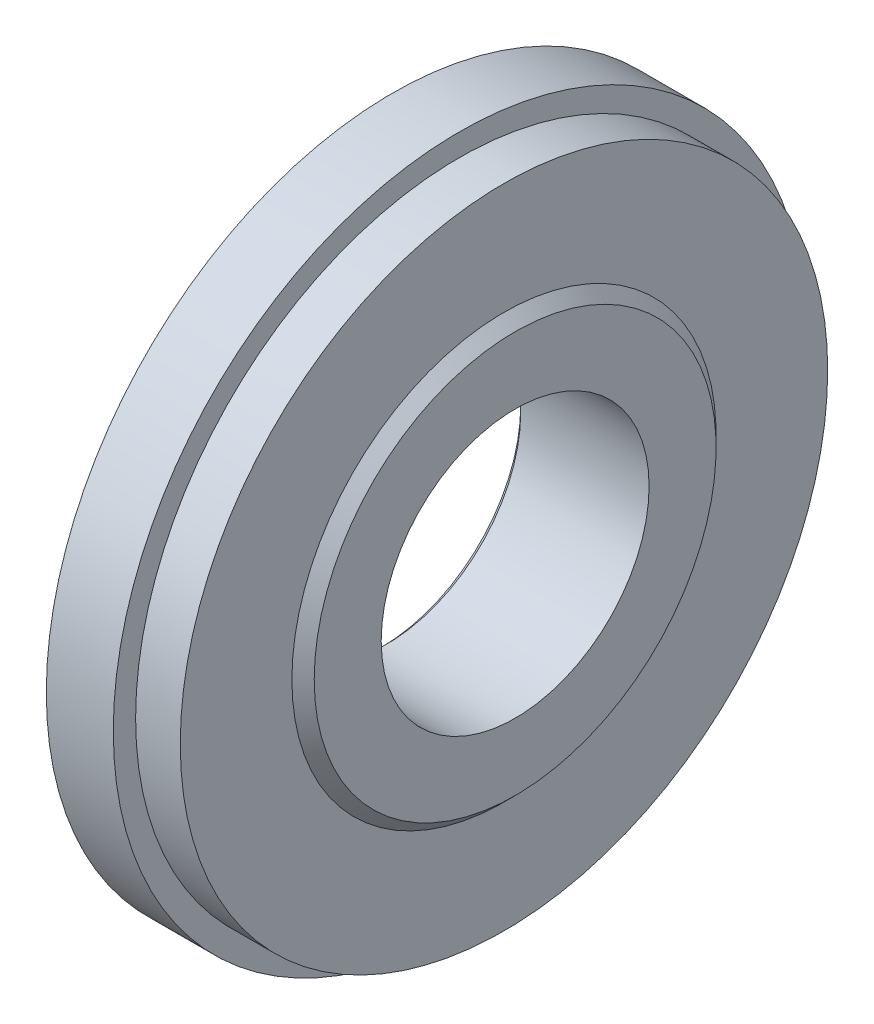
ISO-10303-21;
HEADER;
FILE_DESCRIPTION(('STEP AP214'),'2;1');
FILE_NAME('part.step','',(''),(''),'','','');
FILE_SCHEMA(('AUTOMOTIVE_DESIGN { 1 0 10303 214 1 1 1 1 }'));
ENDSEC;
DATA;
#1=APPLICATION_CONTEXT('core data for automotive mechanical design processes');
#2=APPLICATION_PROTOCOL_DEFINITION('international standard','automotive_design',2000,#1);
#3=PRODUCT_CONTEXT('',#1,'mechanical');
#4=PRODUCT('Part','Part','',(#3));
#5=PRODUCT_RELATED_PRODUCT_CATEGORY('part','',(#4));
#6=PRODUCT_DEFINITION_FORMATION('','',#4);
#7=PRODUCT_DEFINITION_CONTEXT('part definition',#1,'design');
#8=PRODUCT_DEFINITION('design','',#6,#7);
#9=PRODUCT_DEFINITION_SHAPE('','',#8);
#10=(LENGTH_UNIT() NAMED_UNIT(*) SI_UNIT(.MILLI.,.METRE.));
#11=(NAMED_UNIT(*) PLANE_ANGLE_UNIT() SI_UNIT($,.RADIAN.));
#12=(NAMED_UNIT(*) SI_UNIT($,.STERADIAN.) SOLID_ANGLE_UNIT());
#13=UNCERTAINTY_MEASURE_WITH_UNIT(LENGTH_MEASURE(1.E-05),#10,'distance_accuracy_value','');
#14=(GEOMETRIC_REPRESENTATION_CONTEXT(3) GLOBAL_UNCERTAINTY_ASSIGNED_CONTEXT((#13)) GLOBAL_UNIT_ASSIGNED_CONTEXT((#10,
#11,#12)) REPRESENTATION_CONTEXT('',''));
#15=CARTESIAN_POINT('',(0.,0.,0.));
#16=DIRECTION('',(0.,0.,1.));
#17=DIRECTION('',(1.,0.,0.));
#18=AXIS2_PLACEMENT_3D('',#15,#16,#17);
#19=CARTESIAN_POINT('',(-8.00000000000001,0.,0.));
#20=DIRECTION('',(-1.,0.,0.));
#21=DIRECTION('',(0.,0.,1.));
#22=AXIS2_PLACEMENT_3D('',#19,#20,#21);
#23=CYLINDRICAL_SURFACE('',#22,16.);
#24=CARTESIAN_POINT('',(0.500000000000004,0.,0.));
#25=DIRECTION('',(-1.,0.,0.));
#26=DIRECTION('',(0.,0.,1.));
#27=AXIS2_PLACEMENT_3D('',#24,#25,#26);
#28=CIRCLE('',#27,16.);
#29=CARTESIAN_POINT('',(0.500000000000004,0.,16.));
#30=VERTEX_POINT('',#29);
#31=EDGE_CURVE('E10',#30,#30,#28,.F.);
#32=ORIENTED_EDGE('',*,*,#31,.T.);
#33=EDGE_LOOP('',(#32));
#34=FACE_BOUND('',#33,.T.);
#35=CARTESIAN_POINT('',(5.00000000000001,0.,0.));
#36=DIRECTION('',(-1.,0.,0.));
#37=DIRECTION('',(0.,0.,1.));
#38=AXIS2_PLACEMENT_3D('',#35,#36,#37);
#39=CIRCLE('',#38,16.);
#40=CARTESIAN_POINT('',(5.00000000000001,0.,16.));
#41=VERTEX_POINT('',#40);
#42=EDGE_CURVE('E50',#41,#41,#39,.T.);
#43=ORIENTED_EDGE('',*,*,#42,.T.);
#44=EDGE_LOOP('',(#43));
#45=FACE_BOUND('',#44,.T.);
#46=ADVANCED_FACE('F31',(#34,#45),#23,.T.);
#47=CARTESIAN_POINT('',(5.00000000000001,0.,0.));
#48=DIRECTION('',(-1.,0.,0.));
#49=DIRECTION('',(0.,0.,1.));
#50=AXIS2_PLACEMENT_3D('',#47,#48,#49);
#51=TOROIDAL_SURFACE('',#50,18.,2.);
#52=ORIENTED_EDGE('',*,*,#42,.F.);
#53=EDGE_LOOP('',(#52));
#54=FACE_BOUND('',#53,.T.);
#55=CARTESIAN_POINT('',(7.00000000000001,0.,0.));
#56=DIRECTION('',(-1.,0.,0.));
#57=DIRECTION('',(0.,0.,1.));
#58=AXIS2_PLACEMENT_3D('',#55,#56,#57);
#59=CIRCLE('',#58,18.);
#60=CARTESIAN_POINT('',(7.00000000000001,0.,18.));
#61=VERTEX_POINT('',#60);
#62=EDGE_CURVE('E53',#61,#61,#59,.T.);
#63=ORIENTED_EDGE('',*,*,#62,.T.);
#64=EDGE_LOOP('',(#63));
#65=FACE_BOUND('',#64,.T.);
#66=ADVANCED_FACE('F104',(#54,#65),#51,.F.);
#67=CARTESIAN_POINT('',(7.00000000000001,18.,0.));
#68=DIRECTION('',(-1.,0.,0.));
#69=DIRECTION('',(0.,0.,1.));
#70=AXIS2_PLACEMENT_3D('',#67,#68,#69);
#71=PLANE('',#70);
#72=CARTESIAN_POINT('',(7.00000000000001,0.,0.));
#73=DIRECTION('',(-1.,0.,0.));
#74=DIRECTION('',(0.,0.,1.));
#75=AXIS2_PLACEMENT_3D('',#72,#73,#74);
#76=CIRCLE('',#75,26.);
#77=CARTESIAN_POINT('',(7.00000000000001,0.,26.));
#78=VERTEX_POINT('',#77);
#79=EDGE_CURVE('E56',#78,#78,#76,.T.);
#80=ORIENTED_EDGE('',*,*,#79,.T.);
#81=EDGE_LOOP('',(#80));
#82=FACE_BOUND('',#81,.T.);
#83=ORIENTED_EDGE('',*,*,#62,.F.);
#84=EDGE_LOOP('',(#83));
#85=FACE_BOUND('',#84,.T.);
#86=ADVANCED_FACE('F108',(#82,#85),#71,.T.);
#87=CARTESIAN_POINT('',(5.00000000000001,0.,0.));
#88=DIRECTION('',(-1.,0.,0.));
#89=DIRECTION('',(0.,0.,1.));
#90=AXIS2_PLACEMENT_3D('',#87,#88,#89);
#91=TOROIDAL_SURFACE('',#90,26.,2.);
#92=ORIENTED_EDGE('',*,*,#79,.F.);
#93=EDGE_LOOP('',(#92));
#94=FACE_BOUND('',#93,.T.);
#95=CARTESIAN_POINT('',(5.00000000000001,0.,0.));
#96=DIRECTION('',(-1.,0.,0.));
#97=DIRECTION('',(0.,0.,1.));
#98=AXIS2_PLACEMENT_3D('',#95,#96,#97);
#99=CIRCLE('',#98,28.);
#100=CARTESIAN_POINT('',(5.00000000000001,0.,28.));
#101=VERTEX_POINT('',#100);
#102=EDGE_CURVE('E59',#101,#101,#99,.T.);
#103=ORIENTED_EDGE('',*,*,#102,.T.);
#104=EDGE_LOOP('',(#103));
#105=FACE_BOUND('',#104,.T.);
#106=ADVANCED_FACE('F116',(#94,#105),#91,.F.);
#107=CARTESIAN_POINT('',(-8.00000000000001,0.,0.));
#108=DIRECTION('',(-1.,0.,0.));
#109=DIRECTION('',(0.,0.,1.));
#110=AXIS2_PLACEMENT_3D('',#107,#108,#109);
#111=CYLINDRICAL_SURFACE('',#110,28.);
#112=CARTESIAN_POINT('',(1.,0.,0.));
#113=DIRECTION('',(-1.,0.,0.));
#114=DIRECTION('',(0.,0.,1.));
#115=AXIS2_PLACEMENT_3D('',#112,#113,#114);
#116=CIRCLE('',#115,28.);
#117=CARTESIAN_POINT('',(1.,0.,28.));
#118=VERTEX_POINT('',#117);
#119=EDGE_CURVE('E62',#118,#118,#116,.T.);
#120=ORIENTED_EDGE('',*,*,#119,.T.);
#121=EDGE_LOOP('',(#120));
#122=FACE_BOUND('',#121,.T.);
#123=ORIENTED_EDGE('',*,*,#102,.F.);
#124=EDGE_LOOP('',(#123));
#125=FACE_BOUND('',#124,.T.);
#126=ADVANCED_FACE('F122',(#122,#125),#111,.F.);
#127=CARTESIAN_POINT('',(1.,28.,0.));
#128=DIRECTION('',(-1.,0.,0.));
#129=DIRECTION('',(0.,0.,1.));
#130=AXIS2_PLACEMENT_3D('',#127,#128,#129);
#131=PLANE('',#130);
#132=CARTESIAN_POINT('',(1.,0.,0.));
#133=DIRECTION('',(-1.,0.,0.));
#134=DIRECTION('',(0.,0.,1.));
#135=AXIS2_PLACEMENT_3D('',#132,#133,#134);
#136=CIRCLE('',#135,31.);
#137=CARTESIAN_POINT('',(1.,0.,31.));
#138=VERTEX_POINT('',#137);
#139=EDGE_CURVE('E65',#138,#138,#136,.T.);
#140=ORIENTED_EDGE('',*,*,#139,.T.);
#141=EDGE_LOOP('',(#140));
#142=FACE_BOUND('',#141,.T.);
#143=ORIENTED_EDGE('',*,*,#119,.F.);
#144=EDGE_LOOP('',(#143));
#145=FACE_BOUND('',#144,.T.);
#146=ADVANCED_FACE('F128',(#142,#145),#131,.T.);
#147=CARTESIAN_POINT('',(-8.00000000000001,0.,0.));
#148=DIRECTION('',(-1.,0.,0.));
#149=DIRECTION('',(0.,0.,1.));
#150=AXIS2_PLACEMENT_3D('',#147,#148,#149);
#151=CYLINDRICAL_SURFACE('',#150,31.);
#152=CARTESIAN_POINT('',(7.,0.,0.));
#153=DIRECTION('',(-1.,0.,0.));
#154=DIRECTION('',(0.,0.,1.));
#155=AXIS2_PLACEMENT_3D('',#152,#153,#154);
#156=CIRCLE('',#155,31.);
#157=CARTESIAN_POINT('',(7.,0.,31.));
#158=VERTEX_POINT('',#157);
#159=EDGE_CURVE('E68',#158,#158,#156,.T.);
#160=ORIENTED_EDGE('',*,*,#159,.T.);
#161=EDGE_LOOP('',(#160));
#162=FACE_BOUND('',#161,.T.);
#163=ORIENTED_EDGE('',*,*,#139,.F.);
#164=EDGE_LOOP('',(#163));
#165=FACE_BOUND('',#164,.T.);
#166=ADVANCED_FACE('F132',(#162,#165),#151,.T.);
#167=CARTESIAN_POINT('',(7.,31.,0.));
#168=DIRECTION('',(1.,0.,0.));
#169=DIRECTION('',(0.,0.,-1.));
#170=AXIS2_PLACEMENT_3D('',#167,#168,#169);
#171=PLANE('',#170);
#172=CARTESIAN_POINT('',(7.,0.,0.));
#173=DIRECTION('',(-1.,0.,0.));
#174=DIRECTION('',(0.,0.,1.));
#175=AXIS2_PLACEMENT_3D('',#172,#173,#174);
#176=CIRCLE('',#175,29.);
#177=CARTESIAN_POINT('',(7.,0.,29.));
#178=VERTEX_POINT('',#177);
#179=EDGE_CURVE('E71',#178,#178,#176,.T.);
#180=ORIENTED_EDGE('',*,*,#179,.T.);
#181=EDGE_LOOP('',(#180));
#182=FACE_BOUND('',#181,.T.);
#183=ORIENTED_EDGE('',*,*,#159,.F.);
#184=EDGE_LOOP('',(#183));
#185=FACE_BOUND('',#184,.T.);
#186=ADVANCED_FACE('F136',(#182,#185),#171,.T.);
#187=CARTESIAN_POINT('',(-8.00000000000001,0.,0.));
#188=DIRECTION('',(-1.,0.,0.));
#189=DIRECTION('',(0.,0.,1.));
#190=AXIS2_PLACEMENT_3D('',#187,#188,#189);
#191=CYLINDRICAL_SURFACE('',#190,29.);
#192=CARTESIAN_POINT('',(11.,0.,0.));
#193=DIRECTION('',(-1.,0.,0.));
#194=DIRECTION('',(0.,0.,1.));
#195=AXIS2_PLACEMENT_3D('',#192,#193,#194);
#196=CIRCLE('',#195,29.);
#197=CARTESIAN_POINT('',(11.,0.,29.));
#198=VERTEX_POINT('',#197);
#199=EDGE_CURVE('E74',#198,#198,#196,.T.);
#200=ORIENTED_EDGE('',*,*,#199,.T.);
#201=EDGE_LOOP('',(#200));
#202=FACE_BOUND('',#201,.T.);
#203=ORIENTED_EDGE('',*,*,#179,.F.);
#204=EDGE_LOOP('',(#203));
#205=FACE_BOUND('',#204,.T.);
#206=ADVANCED_FACE('F140',(#202,#205),#191,.T.);
#207=CARTESIAN_POINT('',(11.,29.,0.));
#208=DIRECTION('',(1.,0.,0.));
#209=DIRECTION('',(0.,0.,-1.));
#210=AXIS2_PLACEMENT_3D('',#207,#208,#209);
#211=PLANE('',#210);
#212=CARTESIAN_POINT('',(11.,0.,0.));
#213=DIRECTION('',(-1.,0.,0.));
#214=DIRECTION('',(0.,0.,1.));
#215=AXIS2_PLACEMENT_3D('',#212,#213,#214);
#216=CIRCLE('',#215,19.0000000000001);
#217=CARTESIAN_POINT('',(11.,0.,19.0000000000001));
#218=VERTEX_POINT('',#217);
#219=EDGE_CURVE('E77',#218,#218,#216,.T.);
#220=ORIENTED_EDGE('',*,*,#219,.T.);
#221=EDGE_LOOP('',(#220));
#222=FACE_BOUND('',#221,.T.);
#223=ORIENTED_EDGE('',*,*,#199,.F.);
#224=EDGE_LOOP('',(#223));
#225=FACE_BOUND('',#224,.T.);
#226=ADVANCED_FACE('F144',(#222,#225),#211,.T.);
#227=CARTESIAN_POINT('',(11.,0.,0.));
#228=DIRECTION('',(-1.,0.,0.));
#229=DIRECTION('',(0.,0.,1.));
#230=AXIS2_PLACEMENT_3D('',#227,#228,#229);
#231=CONICAL_SURFACE('',#230,19.0000000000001,0.785398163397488);
#232=CARTESIAN_POINT('',(12.,0.,0.));
#233=DIRECTION('',(-1.,0.,0.));
#234=DIRECTION('',(0.,0.,1.));
#235=AXIS2_PLACEMENT_3D('',#232,#233,#234);
#236=CIRCLE('',#235,18.0000000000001);
#237=CARTESIAN_POINT('',(12.,0.,18.0000000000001));
#238=VERTEX_POINT('',#237);
#239=EDGE_CURVE('E80',#238,#238,#236,.T.);
#240=ORIENTED_EDGE('',*,*,#239,.T.);
#241=EDGE_LOOP('',(#240));
#242=FACE_BOUND('',#241,.T.);
#243=ORIENTED_EDGE('',*,*,#219,.F.);
#244=EDGE_LOOP('',(#243));
#245=FACE_BOUND('',#244,.T.);
#246=ADVANCED_FACE('F101',(#242,#245),#231,.T.);
#247=CARTESIAN_POINT('',(12.,18.0000000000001,0.));
#248=DIRECTION('',(1.,0.,0.));
#249=DIRECTION('',(0.,0.,-1.));
#250=AXIS2_PLACEMENT_3D('',#247,#248,#249);
#251=PLANE('',#250);
#252=CARTESIAN_POINT('',(12.,0.,0.));
#253=DIRECTION('',(-1.,0.,0.));
#254=DIRECTION('',(0.,0.,1.));
#255=AXIS2_PLACEMENT_3D('',#252,#253,#254);
#256=CIRCLE('',#255,12.);
#257=CARTESIAN_POINT('',(12.,0.,12.));
#258=VERTEX_POINT('',#257);
#259=EDGE_CURVE('E83',#258,#258,#256,.T.);
#260=ORIENTED_EDGE('',*,*,#259,.T.);
#261=EDGE_LOOP('',(#260));
#262=FACE_BOUND('',#261,.T.);
#263=ORIENTED_EDGE('',*,*,#239,.F.);
#264=EDGE_LOOP('',(#263));
#265=FACE_BOUND('',#264,.T.);
#266=ADVANCED_FACE('F87',(#262,#265),#251,.T.);
#267=CARTESIAN_POINT('',(-8.00000000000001,0.,0.));
#268=DIRECTION('',(-1.,0.,0.));
#269=DIRECTION('',(0.,0.,1.));
#270=AXIS2_PLACEMENT_3D('',#267,#268,#269);
#271=CYLINDRICAL_SURFACE('',#270,12.);
#272=CARTESIAN_POINT('',(0.500000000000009,0.,0.));
#273=DIRECTION('',(-1.,0.,0.));
#274=DIRECTION('',(0.,0.,1.));
#275=AXIS2_PLACEMENT_3D('',#272,#273,#274);
#276=CIRCLE('',#275,12.);
#277=CARTESIAN_POINT('',(0.500000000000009,0.,12.));
#278=VERTEX_POINT('',#277);
#279=EDGE_CURVE('E45',#278,#278,#276,.T.);
#280=ORIENTED_EDGE('',*,*,#279,.T.);
#281=EDGE_LOOP('',(#280));
#282=FACE_BOUND('',#281,.T.);
#283=ORIENTED_EDGE('',*,*,#259,.F.);
#284=EDGE_LOOP('',(#283));
#285=FACE_BOUND('',#284,.T.);
#286=ADVANCED_FACE('F90',(#282,#285),#271,.F.);
#287=CARTESIAN_POINT('',(0.,12.,0.));
#288=DIRECTION('',(-1.,0.,0.));
#289=DIRECTION('',(0.,0.,1.));
#290=AXIS2_PLACEMENT_3D('',#287,#288,#289);
#291=PLANE('',#290);
#292=CARTESIAN_POINT('',(0.,0.,0.));
#293=DIRECTION('',(-1.,0.,0.));
#294=DIRECTION('',(0.,0.,1.));
#295=AXIS2_PLACEMENT_3D('',#292,#293,#294);
#296=CIRCLE('',#295,12.5);
#297=CARTESIAN_POINT('',(0.,0.,12.5));
#298=VERTEX_POINT('',#297);
#299=EDGE_CURVE('E37',#298,#298,#296,.F.);
#300=ORIENTED_EDGE('',*,*,#299,.T.);
#301=EDGE_LOOP('',(#300));
#302=FACE_BOUND('',#301,.T.);
#303=CARTESIAN_POINT('',(0.,0.,0.));
#304=DIRECTION('',(-1.,0.,0.));
#305=DIRECTION('',(0.,0.,1.));
#306=AXIS2_PLACEMENT_3D('',#303,#304,#305);
#307=CIRCLE('',#306,15.5);
#308=CARTESIAN_POINT('',(0.,0.,15.5));
#309=VERTEX_POINT('',#308);
#310=EDGE_CURVE('E41',#309,#309,#307,.T.);
#311=ORIENTED_EDGE('',*,*,#310,.T.);
#312=EDGE_LOOP('',(#311));
#313=FACE_BOUND('',#312,.T.);
#314=ADVANCED_FACE('F92',(#302,#313),#291,.T.);
#315=CARTESIAN_POINT('',(0.500000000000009,0.,0.));
#316=DIRECTION('',(-1.,0.,0.));
#317=DIRECTION('',(0.,0.,1.));
#318=AXIS2_PLACEMENT_3D('',#315,#316,#317);
#319=CONICAL_SURFACE('',#318,12.,0.785398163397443);
#320=ORIENTED_EDGE('',*,*,#299,.F.);
#321=EDGE_LOOP('',(#320));
#322=FACE_BOUND('',#321,.T.);
#323=ORIENTED_EDGE('',*,*,#279,.F.);
#324=EDGE_LOOP('',(#323));
#325=FACE_BOUND('',#324,.T.);
#326=ADVANCED_FACE('F99',(#322,#325),#319,.F.);
#327=CARTESIAN_POINT('',(0.,0.,0.));
#328=DIRECTION('',(1.,0.,0.));
#329=DIRECTION('',(0.,0.,-1.));
#330=AXIS2_PLACEMENT_3D('',#327,#328,#329);
#331=CONICAL_SURFACE('',#330,15.5,0.785398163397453);
#332=ORIENTED_EDGE('',*,*,#31,.F.);
#333=EDGE_LOOP('',(#332));
#334=FACE_BOUND('',#333,.T.);
#335=ORIENTED_EDGE('',*,*,#310,.F.);
#336=EDGE_LOOP('',(#335));
#337=FACE_BOUND('',#336,.T.);
#338=ADVANCED_FACE('F192',(#334,#337),#331,.T.);
#339=CLOSED_SHELL('',(#46,#66,#86,#106,#126,#146,#166,#186,#206,#226,#246,#266,#286,#314,#326,#338));
#340=MANIFOLD_SOLID_BREP('B2',#339);
#341=ADVANCED_BREP_SHAPE_REPRESENTATION('',(#18,#340),#14);
#342=SHAPE_DEFINITION_REPRESENTATION(#9,#341);
ENDSEC;
END-ISO-10303-21;
